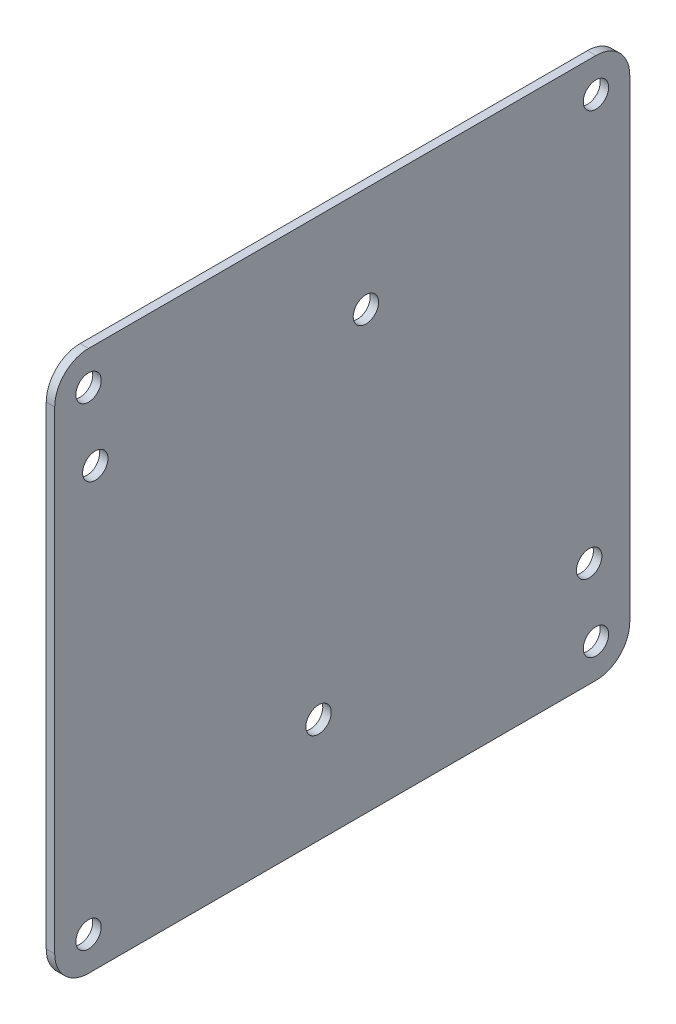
ISO-10303-21;
HEADER;
FILE_DESCRIPTION(('STEP AP214'),'2;1');
FILE_NAME('part.step','',(''),(''),'','','');
FILE_SCHEMA(('AUTOMOTIVE_DESIGN { 1 0 10303 214 1 1 1 1 }'));
ENDSEC;
DATA;
#1=APPLICATION_CONTEXT('core data for automotive mechanical design processes');
#2=APPLICATION_PROTOCOL_DEFINITION('international standard','automotive_design',2000,#1);
#3=PRODUCT_CONTEXT('',#1,'mechanical');
#4=PRODUCT('Part','Part','',(#3));
#5=PRODUCT_RELATED_PRODUCT_CATEGORY('part','',(#4));
#6=PRODUCT_DEFINITION_FORMATION('','',#4);
#7=PRODUCT_DEFINITION_CONTEXT('part definition',#1,'design');
#8=PRODUCT_DEFINITION('design','',#6,#7);
#9=PRODUCT_DEFINITION_SHAPE('','',#8);
#10=(LENGTH_UNIT() NAMED_UNIT(*) SI_UNIT(.MILLI.,.METRE.));
#11=(NAMED_UNIT(*) PLANE_ANGLE_UNIT() SI_UNIT($,.RADIAN.));
#12=(NAMED_UNIT(*) SI_UNIT($,.STERADIAN.) SOLID_ANGLE_UNIT());
#13=UNCERTAINTY_MEASURE_WITH_UNIT(LENGTH_MEASURE(1.E-05),#10,'distance_accuracy_value','');
#14=(GEOMETRIC_REPRESENTATION_CONTEXT(3) GLOBAL_UNCERTAINTY_ASSIGNED_CONTEXT((#13)) GLOBAL_UNIT_ASSIGNED_CONTEXT((#10,
#11,#12)) REPRESENTATION_CONTEXT('',''));
#15=CARTESIAN_POINT('',(0.,0.,0.));
#16=DIRECTION('',(0.,0.,1.));
#17=DIRECTION('',(1.,0.,0.));
#18=AXIS2_PLACEMENT_3D('',#15,#16,#17);
#19=CARTESIAN_POINT('',(1.5875,0.,0.));
#20=DIRECTION('',(1.,0.,0.));
#21=DIRECTION('',(0.,0.,-1.));
#22=AXIS2_PLACEMENT_3D('',#19,#20,#21);
#23=PLANE('',#22);
#24=CARTESIAN_POINT('',(1.5875,-31.115,-46.355));
#25=DIRECTION('',(1.,0.,0.));
#26=DIRECTION('',(0.,0.,-1.));
#27=AXIS2_PLACEMENT_3D('',#24,#25,#26);
#28=CIRCLE('',#27,2.38125);
#29=CARTESIAN_POINT('',(1.5875,-31.115,-48.73625));
#30=VERTEX_POINT('',#29);
#31=EDGE_CURVE('E213',#30,#30,#28,.T.);
#32=ORIENTED_EDGE('',*,*,#31,.F.);
#33=EDGE_LOOP('',(#32));
#34=FACE_BOUND('',#33,.T.);
#35=CARTESIAN_POINT('',(1.5875,31.115,-4.44500000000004));
#36=DIRECTION('',(1.,0.,0.));
#37=DIRECTION('',(0.,0.,-1.));
#38=AXIS2_PLACEMENT_3D('',#35,#36,#37);
#39=CIRCLE('',#38,2.38125);
#40=CARTESIAN_POINT('',(1.5875,31.115,-6.82625000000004));
#41=VERTEX_POINT('',#40);
#42=EDGE_CURVE('E207',#41,#41,#39,.T.);
#43=ORIENTED_EDGE('',*,*,#42,.F.);
#44=EDGE_LOOP('',(#43));
#45=FACE_BOUND('',#44,.T.);
#46=CARTESIAN_POINT('',(1.5875,-31.115,4.44499999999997));
#47=DIRECTION('',(1.,0.,0.));
#48=DIRECTION('',(0.,0.,-1.));
#49=AXIS2_PLACEMENT_3D('',#46,#47,#48);
#50=CIRCLE('',#49,2.38125);
#51=CARTESIAN_POINT('',(1.5875,-31.115,2.06374999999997));
#52=VERTEX_POINT('',#51);
#53=EDGE_CURVE('E201',#52,#52,#50,.T.);
#54=ORIENTED_EDGE('',*,*,#53,.F.);
#55=EDGE_LOOP('',(#54));
#56=FACE_BOUND('',#55,.T.);
#57=CARTESIAN_POINT('',(1.5875,31.115,46.355));
#58=DIRECTION('',(1.,0.,0.));
#59=DIRECTION('',(0.,0.,-1.));
#60=AXIS2_PLACEMENT_3D('',#57,#58,#59);
#61=CIRCLE('',#60,2.38125);
#62=CARTESIAN_POINT('',(1.5875,31.115,43.97375));
#63=VERTEX_POINT('',#62);
#64=EDGE_CURVE('E195',#63,#63,#61,.T.);
#65=ORIENTED_EDGE('',*,*,#64,.F.);
#66=EDGE_LOOP('',(#65));
#67=FACE_BOUND('',#66,.T.);
#68=CARTESIAN_POINT('',(1.5875,-44.45,-47.625));
#69=DIRECTION('',(1.,0.,0.));
#70=DIRECTION('',(0.,0.,-1.));
#71=AXIS2_PLACEMENT_3D('',#68,#69,#70);
#72=CIRCLE('',#71,2.38125);
#73=CARTESIAN_POINT('',(1.5875,-44.45,-50.00625));
#74=VERTEX_POINT('',#73);
#75=EDGE_CURVE('E180',#74,#74,#72,.T.);
#76=ORIENTED_EDGE('',*,*,#75,.F.);
#77=EDGE_LOOP('',(#76));
#78=FACE_BOUND('',#77,.T.);
#79=CARTESIAN_POINT('',(1.5875,44.45,47.625));
#80=DIRECTION('',(1.,0.,0.));
#81=DIRECTION('',(0.,0.,-1.));
#82=AXIS2_PLACEMENT_3D('',#79,#80,#81);
#83=CIRCLE('',#82,2.38125);
#84=CARTESIAN_POINT('',(1.5875,44.45,45.24375));
#85=VERTEX_POINT('',#84);
#86=EDGE_CURVE('E163',#85,#85,#83,.T.);
#87=ORIENTED_EDGE('',*,*,#86,.F.);
#88=EDGE_LOOP('',(#87));
#89=FACE_BOUND('',#88,.T.);
#90=DIRECTION('',(0.,-1.,0.));
#91=VECTOR('',#90,1.);
#92=CARTESIAN_POINT('',(1.5875,50.8,53.975));
#93=LINE('',#92,#91);
#94=CARTESIAN_POINT('',(1.5875,44.45,53.975));
#95=VERTEX_POINT('',#94);
#96=CARTESIAN_POINT('',(1.5875,-44.45,53.975));
#97=VERTEX_POINT('',#96);
#98=EDGE_CURVE('E170',#95,#97,#93,.T.);
#99=ORIENTED_EDGE('',*,*,#98,.T.);
#100=CARTESIAN_POINT('',(1.5875,-44.45,47.625));
#101=DIRECTION('',(1.,0.,0.));
#102=DIRECTION('',(0.,0.,-1.));
#103=AXIS2_PLACEMENT_3D('',#100,#101,#102);
#104=CIRCLE('',#103,6.35);
#105=CARTESIAN_POINT('',(1.5875,-50.8,47.625));
#106=VERTEX_POINT('',#105);
#107=EDGE_CURVE('E147',#97,#106,#104,.T.);
#108=ORIENTED_EDGE('',*,*,#107,.T.);
#109=DIRECTION('',(0.,0.,-1.));
#110=VECTOR('',#109,1.);
#111=CARTESIAN_POINT('',(1.5875,-50.8,53.975));
#112=LINE('',#111,#110);
#113=CARTESIAN_POINT('',(1.5875,-50.8,-47.625));
#114=VERTEX_POINT('',#113);
#115=EDGE_CURVE('E118',#106,#114,#112,.T.);
#116=ORIENTED_EDGE('',*,*,#115,.T.);
#117=CARTESIAN_POINT('',(1.5875,-44.45,-47.625));
#118=DIRECTION('',(1.,0.,0.));
#119=DIRECTION('',(0.,0.,-1.));
#120=AXIS2_PLACEMENT_3D('',#117,#118,#119);
#121=CIRCLE('',#120,6.35);
#122=CARTESIAN_POINT('',(1.5875,-44.45,-53.975));
#123=VERTEX_POINT('',#122);
#124=EDGE_CURVE('E145',#114,#123,#121,.T.);
#125=ORIENTED_EDGE('',*,*,#124,.T.);
#126=DIRECTION('',(0.,1.,0.));
#127=VECTOR('',#126,1.);
#128=CARTESIAN_POINT('',(1.5875,50.8,-53.975));
#129=LINE('',#128,#127);
#130=CARTESIAN_POINT('',(1.5875,44.45,-53.975));
#131=VERTEX_POINT('',#130);
#132=EDGE_CURVE('E125',#123,#131,#129,.T.);
#133=ORIENTED_EDGE('',*,*,#132,.T.);
#134=CARTESIAN_POINT('',(1.5875,44.45,-47.625));
#135=DIRECTION('',(1.,0.,0.));
#136=DIRECTION('',(0.,0.,-1.));
#137=AXIS2_PLACEMENT_3D('',#134,#135,#136);
#138=CIRCLE('',#137,6.35);
#139=CARTESIAN_POINT('',(1.5875,50.8,-47.625));
#140=VERTEX_POINT('',#139);
#141=EDGE_CURVE('E53',#131,#140,#138,.T.);
#142=ORIENTED_EDGE('',*,*,#141,.T.);
#143=DIRECTION('',(0.,0.,1.));
#144=VECTOR('',#143,1.);
#145=CARTESIAN_POINT('',(1.5875,50.8,53.975));
#146=LINE('',#145,#144);
#147=CARTESIAN_POINT('',(1.5875,50.8,47.625));
#148=VERTEX_POINT('',#147);
#149=EDGE_CURVE('E128',#140,#148,#146,.T.);
#150=ORIENTED_EDGE('',*,*,#149,.T.);
#151=CARTESIAN_POINT('',(1.5875,44.45,47.625));
#152=DIRECTION('',(1.,0.,0.));
#153=DIRECTION('',(0.,0.,-1.));
#154=AXIS2_PLACEMENT_3D('',#151,#152,#153);
#155=CIRCLE('',#154,6.35);
#156=EDGE_CURVE('E142',#148,#95,#155,.T.);
#157=ORIENTED_EDGE('',*,*,#156,.T.);
#158=EDGE_LOOP('',(#99,#108,#116,#125,#133,#142,#150,#157));
#159=FACE_BOUND('',#158,.T.);
#160=CARTESIAN_POINT('',(1.5875,44.45,-47.625));
#161=DIRECTION('',(1.,0.,0.));
#162=DIRECTION('',(0.,0.,-1.));
#163=AXIS2_PLACEMENT_3D('',#160,#161,#162);
#164=CIRCLE('',#163,2.38125);
#165=CARTESIAN_POINT('',(1.5875,44.45,-50.00625));
#166=VERTEX_POINT('',#165);
#167=EDGE_CURVE('E175',#166,#166,#164,.T.);
#168=ORIENTED_EDGE('',*,*,#167,.F.);
#169=EDGE_LOOP('',(#168));
#170=FACE_BOUND('',#169,.T.);
#171=CARTESIAN_POINT('',(1.5875,-44.45,47.625));
#172=DIRECTION('',(1.,0.,0.));
#173=DIRECTION('',(0.,0.,-1.));
#174=AXIS2_PLACEMENT_3D('',#171,#172,#173);
#175=CIRCLE('',#174,2.38125);
#176=CARTESIAN_POINT('',(1.5875,-44.45,45.24375));
#177=VERTEX_POINT('',#176);
#178=EDGE_CURVE('E186',#177,#177,#175,.T.);
#179=ORIENTED_EDGE('',*,*,#178,.F.);
#180=EDGE_LOOP('',(#179));
#181=FACE_BOUND('',#180,.T.);
#182=ADVANCED_FACE('F32',(#34,#45,#56,#67,#78,#89,#159,#170,#181),#23,.T.);
#183=CARTESIAN_POINT('',(0.,0.,0.));
#184=DIRECTION('',(1.,0.,0.));
#185=DIRECTION('',(0.,0.,-1.));
#186=AXIS2_PLACEMENT_3D('',#183,#184,#185);
#187=PLANE('',#186);
#188=CARTESIAN_POINT('',(0.,-31.115,-46.355));
#189=DIRECTION('',(1.,0.,0.));
#190=DIRECTION('',(0.,0.,-1.));
#191=AXIS2_PLACEMENT_3D('',#188,#189,#190);
#192=CIRCLE('',#191,2.38125);
#193=CARTESIAN_POINT('',(0.,-31.115,-48.73625));
#194=VERTEX_POINT('',#193);
#195=EDGE_CURVE('E210',#194,#194,#192,.T.);
#196=ORIENTED_EDGE('',*,*,#195,.T.);
#197=EDGE_LOOP('',(#196));
#198=FACE_BOUND('',#197,.T.);
#199=CARTESIAN_POINT('',(0.,31.115,-4.44500000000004));
#200=DIRECTION('',(1.,0.,0.));
#201=DIRECTION('',(0.,0.,-1.));
#202=AXIS2_PLACEMENT_3D('',#199,#200,#201);
#203=CIRCLE('',#202,2.38125);
#204=CARTESIAN_POINT('',(0.,31.115,-6.82625000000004));
#205=VERTEX_POINT('',#204);
#206=EDGE_CURVE('E204',#205,#205,#203,.T.);
#207=ORIENTED_EDGE('',*,*,#206,.T.);
#208=EDGE_LOOP('',(#207));
#209=FACE_BOUND('',#208,.T.);
#210=CARTESIAN_POINT('',(0.,-31.115,4.44499999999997));
#211=DIRECTION('',(1.,0.,0.));
#212=DIRECTION('',(0.,0.,-1.));
#213=AXIS2_PLACEMENT_3D('',#210,#211,#212);
#214=CIRCLE('',#213,2.38125);
#215=CARTESIAN_POINT('',(0.,-31.115,2.06374999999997));
#216=VERTEX_POINT('',#215);
#217=EDGE_CURVE('E198',#216,#216,#214,.T.);
#218=ORIENTED_EDGE('',*,*,#217,.T.);
#219=EDGE_LOOP('',(#218));
#220=FACE_BOUND('',#219,.T.);
#221=CARTESIAN_POINT('',(0.,31.115,46.355));
#222=DIRECTION('',(1.,0.,0.));
#223=DIRECTION('',(0.,0.,-1.));
#224=AXIS2_PLACEMENT_3D('',#221,#222,#223);
#225=CIRCLE('',#224,2.38125);
#226=CARTESIAN_POINT('',(0.,31.115,43.97375));
#227=VERTEX_POINT('',#226);
#228=EDGE_CURVE('E192',#227,#227,#225,.T.);
#229=ORIENTED_EDGE('',*,*,#228,.T.);
#230=EDGE_LOOP('',(#229));
#231=FACE_BOUND('',#230,.T.);
#232=DIRECTION('',(0.,0.,-1.));
#233=VECTOR('',#232,1.);
#234=CARTESIAN_POINT('',(0.,-50.8,53.975));
#235=LINE('',#234,#233);
#236=CARTESIAN_POINT('',(0.,-50.8,47.625));
#237=VERTEX_POINT('',#236);
#238=CARTESIAN_POINT('',(0.,-50.8,-47.625));
#239=VERTEX_POINT('',#238);
#240=EDGE_CURVE('E115',#237,#239,#235,.T.);
#241=ORIENTED_EDGE('',*,*,#240,.F.);
#242=CARTESIAN_POINT('',(0.,-44.45,47.625));
#243=DIRECTION('',(1.,0.,0.));
#244=DIRECTION('',(0.,0.,-1.));
#245=AXIS2_PLACEMENT_3D('',#242,#243,#244);
#246=CIRCLE('',#245,6.35);
#247=CARTESIAN_POINT('',(0.,-44.45,53.975));
#248=VERTEX_POINT('',#247);
#249=EDGE_CURVE('E98',#237,#248,#246,.F.);
#250=ORIENTED_EDGE('',*,*,#249,.T.);
#251=DIRECTION('',(0.,-1.,0.));
#252=VECTOR('',#251,1.);
#253=CARTESIAN_POINT('',(0.,50.8,53.975));
#254=LINE('',#253,#252);
#255=CARTESIAN_POINT('',(0.,44.45,53.975));
#256=VERTEX_POINT('',#255);
#257=EDGE_CURVE('E126',#256,#248,#254,.T.);
#258=ORIENTED_EDGE('',*,*,#257,.F.);
#259=CARTESIAN_POINT('',(0.,44.45,47.625));
#260=DIRECTION('',(1.,0.,0.));
#261=DIRECTION('',(0.,0.,-1.));
#262=AXIS2_PLACEMENT_3D('',#259,#260,#261);
#263=CIRCLE('',#262,6.35);
#264=CARTESIAN_POINT('',(0.,50.8,47.625));
#265=VERTEX_POINT('',#264);
#266=EDGE_CURVE('E119',#256,#265,#263,.F.);
#267=ORIENTED_EDGE('',*,*,#266,.T.);
#268=DIRECTION('',(0.,0.,1.));
#269=VECTOR('',#268,1.);
#270=CARTESIAN_POINT('',(0.,50.8,53.975));
#271=LINE('',#270,#269);
#272=CARTESIAN_POINT('',(0.,50.8,-47.625));
#273=VERTEX_POINT('',#272);
#274=EDGE_CURVE('E130',#273,#265,#271,.T.);
#275=ORIENTED_EDGE('',*,*,#274,.F.);
#276=CARTESIAN_POINT('',(0.,44.45,-47.625));
#277=DIRECTION('',(1.,0.,0.));
#278=DIRECTION('',(0.,0.,-1.));
#279=AXIS2_PLACEMENT_3D('',#276,#277,#278);
#280=CIRCLE('',#279,6.35);
#281=CARTESIAN_POINT('',(0.,44.45,-53.975));
#282=VERTEX_POINT('',#281);
#283=EDGE_CURVE('E136',#273,#282,#280,.F.);
#284=ORIENTED_EDGE('',*,*,#283,.T.);
#285=DIRECTION('',(0.,1.,0.));
#286=VECTOR('',#285,1.);
#287=CARTESIAN_POINT('',(0.,50.8,-53.975));
#288=LINE('',#287,#286);
#289=CARTESIAN_POINT('',(0.,-44.45,-53.975));
#290=VERTEX_POINT('',#289);
#291=EDGE_CURVE('E158',#290,#282,#288,.T.);
#292=ORIENTED_EDGE('',*,*,#291,.F.);
#293=CARTESIAN_POINT('',(0.,-44.45,-47.625));
#294=DIRECTION('',(1.,0.,0.));
#295=DIRECTION('',(0.,0.,-1.));
#296=AXIS2_PLACEMENT_3D('',#293,#294,#295);
#297=CIRCLE('',#296,6.35);
#298=EDGE_CURVE('E109',#290,#239,#297,.F.);
#299=ORIENTED_EDGE('',*,*,#298,.T.);
#300=EDGE_LOOP('',(#241,#250,#258,#267,#275,#284,#292,#299));
#301=FACE_BOUND('',#300,.T.);
#302=CARTESIAN_POINT('',(0.,44.45,47.625));
#303=DIRECTION('',(1.,0.,0.));
#304=DIRECTION('',(0.,0.,-1.));
#305=AXIS2_PLACEMENT_3D('',#302,#303,#304);
#306=CIRCLE('',#305,2.38125);
#307=CARTESIAN_POINT('',(0.,44.45,45.24375));
#308=VERTEX_POINT('',#307);
#309=EDGE_CURVE('E166',#308,#308,#306,.T.);
#310=ORIENTED_EDGE('',*,*,#309,.T.);
#311=EDGE_LOOP('',(#310));
#312=FACE_BOUND('',#311,.T.);
#313=CARTESIAN_POINT('',(0.,44.45,-47.625));
#314=DIRECTION('',(1.,0.,0.));
#315=DIRECTION('',(0.,0.,-1.));
#316=AXIS2_PLACEMENT_3D('',#313,#314,#315);
#317=CIRCLE('',#316,2.38125);
#318=CARTESIAN_POINT('',(0.,44.45,-50.00625));
#319=VERTEX_POINT('',#318);
#320=EDGE_CURVE('E177',#319,#319,#317,.T.);
#321=ORIENTED_EDGE('',*,*,#320,.T.);
#322=EDGE_LOOP('',(#321));
#323=FACE_BOUND('',#322,.T.);
#324=CARTESIAN_POINT('',(0.,-44.45,-47.625));
#325=DIRECTION('',(1.,0.,0.));
#326=DIRECTION('',(0.,0.,-1.));
#327=AXIS2_PLACEMENT_3D('',#324,#325,#326);
#328=CIRCLE('',#327,2.38125);
#329=CARTESIAN_POINT('',(0.,-44.45,-50.00625));
#330=VERTEX_POINT('',#329);
#331=EDGE_CURVE('E183',#330,#330,#328,.T.);
#332=ORIENTED_EDGE('',*,*,#331,.T.);
#333=EDGE_LOOP('',(#332));
#334=FACE_BOUND('',#333,.T.);
#335=CARTESIAN_POINT('',(0.,-44.45,47.625));
#336=DIRECTION('',(1.,0.,0.));
#337=DIRECTION('',(0.,0.,-1.));
#338=AXIS2_PLACEMENT_3D('',#335,#336,#337);
#339=CIRCLE('',#338,2.38125);
#340=CARTESIAN_POINT('',(0.,-44.45,45.24375));
#341=VERTEX_POINT('',#340);
#342=EDGE_CURVE('E189',#341,#341,#339,.T.);
#343=ORIENTED_EDGE('',*,*,#342,.T.);
#344=EDGE_LOOP('',(#343));
#345=FACE_BOUND('',#344,.T.);
#346=ADVANCED_FACE('F122',(#198,#209,#220,#231,#301,#312,#323,#334,#345),#187,.F.);
#347=CARTESIAN_POINT('',(1.5875,50.8,-53.975));
#348=DIRECTION('',(0.,0.,1.));
#349=DIRECTION('',(0.,-1.,0.));
#350=AXIS2_PLACEMENT_3D('',#347,#348,#349);
#351=PLANE('',#350);
#352=ORIENTED_EDGE('',*,*,#132,.F.);
#353=DIRECTION('',(-1.,0.,0.));
#354=VECTOR('',#353,1.);
#355=CARTESIAN_POINT('',(1.5875,-44.45,-53.975));
#356=LINE('',#355,#354);
#357=EDGE_CURVE('E151',#123,#290,#356,.T.);
#358=ORIENTED_EDGE('',*,*,#357,.T.);
#359=ORIENTED_EDGE('',*,*,#291,.T.);
#360=DIRECTION('',(-1.,0.,0.));
#361=VECTOR('',#360,1.);
#362=CARTESIAN_POINT('',(1.5875,44.45,-53.975));
#363=LINE('',#362,#361);
#364=EDGE_CURVE('E149',#282,#131,#363,.F.);
#365=ORIENTED_EDGE('',*,*,#364,.T.);
#366=EDGE_LOOP('',(#352,#358,#359,#365));
#367=FACE_BOUND('',#366,.T.);
#368=ADVANCED_FACE('F157',(#367),#351,.F.);
#369=CARTESIAN_POINT('',(1.5875,50.8,53.975));
#370=DIRECTION('',(0.,-1.,0.));
#371=DIRECTION('',(0.,0.,-1.));
#372=AXIS2_PLACEMENT_3D('',#369,#370,#371);
#373=PLANE('',#372);
#374=ORIENTED_EDGE('',*,*,#149,.F.);
#375=DIRECTION('',(-1.,0.,0.));
#376=VECTOR('',#375,1.);
#377=CARTESIAN_POINT('',(1.5875,50.8,-47.625));
#378=LINE('',#377,#376);
#379=EDGE_CURVE('E11',#140,#273,#378,.T.);
#380=ORIENTED_EDGE('',*,*,#379,.T.);
#381=ORIENTED_EDGE('',*,*,#274,.T.);
#382=DIRECTION('',(-1.,0.,0.));
#383=VECTOR('',#382,1.);
#384=CARTESIAN_POINT('',(1.5875,50.8,47.625));
#385=LINE('',#384,#383);
#386=EDGE_CURVE('E40',#265,#148,#385,.F.);
#387=ORIENTED_EDGE('',*,*,#386,.T.);
#388=EDGE_LOOP('',(#374,#380,#381,#387));
#389=FACE_BOUND('',#388,.T.);
#390=ADVANCED_FACE('F258',(#389),#373,.F.);
#391=CARTESIAN_POINT('',(1.5875,50.8,53.975));
#392=DIRECTION('',(0.,0.,-1.));
#393=DIRECTION('',(-1.,0.,0.));
#394=AXIS2_PLACEMENT_3D('',#391,#392,#393);
#395=PLANE('',#394);
#396=ORIENTED_EDGE('',*,*,#257,.T.);
#397=DIRECTION('',(-1.,0.,0.));
#398=VECTOR('',#397,1.);
#399=CARTESIAN_POINT('',(1.5875,-44.45,53.975));
#400=LINE('',#399,#398);
#401=EDGE_CURVE('E103',#248,#97,#400,.F.);
#402=ORIENTED_EDGE('',*,*,#401,.T.);
#403=ORIENTED_EDGE('',*,*,#98,.F.);
#404=DIRECTION('',(-1.,0.,0.));
#405=VECTOR('',#404,1.);
#406=CARTESIAN_POINT('',(1.5875,44.45,53.975));
#407=LINE('',#406,#405);
#408=EDGE_CURVE('E108',#95,#256,#407,.T.);
#409=ORIENTED_EDGE('',*,*,#408,.T.);
#410=EDGE_LOOP('',(#396,#402,#403,#409));
#411=FACE_BOUND('',#410,.T.);
#412=ADVANCED_FACE('F265',(#411),#395,.F.);
#413=CARTESIAN_POINT('',(1.5875,-50.8,53.975));
#414=DIRECTION('',(0.,1.,0.));
#415=DIRECTION('',(0.,0.,1.));
#416=AXIS2_PLACEMENT_3D('',#413,#414,#415);
#417=PLANE('',#416);
#418=ORIENTED_EDGE('',*,*,#115,.F.);
#419=DIRECTION('',(-1.,0.,0.));
#420=VECTOR('',#419,1.);
#421=CARTESIAN_POINT('',(1.5875,-50.8,47.625));
#422=LINE('',#421,#420);
#423=EDGE_CURVE('E102',#106,#237,#422,.T.);
#424=ORIENTED_EDGE('',*,*,#423,.T.);
#425=ORIENTED_EDGE('',*,*,#240,.T.);
#426=DIRECTION('',(-1.,0.,0.));
#427=VECTOR('',#426,1.);
#428=CARTESIAN_POINT('',(1.5875,-50.8,-47.625));
#429=LINE('',#428,#427);
#430=EDGE_CURVE('E120',#239,#114,#429,.F.);
#431=ORIENTED_EDGE('',*,*,#430,.T.);
#432=EDGE_LOOP('',(#418,#424,#425,#431));
#433=FACE_BOUND('',#432,.T.);
#434=ADVANCED_FACE('F114',(#433),#417,.F.);
#435=CARTESIAN_POINT('',(1.5875,44.45,47.625));
#436=DIRECTION('',(-1.,0.,0.));
#437=DIRECTION('',(0.,0.,1.));
#438=AXIS2_PLACEMENT_3D('',#435,#436,#437);
#439=CYLINDRICAL_SURFACE('',#438,2.38125);
#440=ORIENTED_EDGE('',*,*,#86,.T.);
#441=EDGE_LOOP('',(#440));
#442=FACE_BOUND('',#441,.T.);
#443=ORIENTED_EDGE('',*,*,#309,.F.);
#444=EDGE_LOOP('',(#443));
#445=FACE_BOUND('',#444,.T.);
#446=ADVANCED_FACE('F264',(#442,#445),#439,.F.);
#447=CARTESIAN_POINT('',(1.5875,44.45,-47.625));
#448=DIRECTION('',(-1.,0.,0.));
#449=DIRECTION('',(0.,0.,1.));
#450=AXIS2_PLACEMENT_3D('',#447,#448,#449);
#451=CYLINDRICAL_SURFACE('',#450,2.38125);
#452=ORIENTED_EDGE('',*,*,#167,.T.);
#453=EDGE_LOOP('',(#452));
#454=FACE_BOUND('',#453,.T.);
#455=ORIENTED_EDGE('',*,*,#320,.F.);
#456=EDGE_LOOP('',(#455));
#457=FACE_BOUND('',#456,.T.);
#458=ADVANCED_FACE('F303',(#454,#457),#451,.F.);
#459=CARTESIAN_POINT('',(1.5875,-44.45,-47.625));
#460=DIRECTION('',(-1.,0.,0.));
#461=DIRECTION('',(0.,0.,1.));
#462=AXIS2_PLACEMENT_3D('',#459,#460,#461);
#463=CYLINDRICAL_SURFACE('',#462,2.38125);
#464=ORIENTED_EDGE('',*,*,#75,.T.);
#465=EDGE_LOOP('',(#464));
#466=FACE_BOUND('',#465,.T.);
#467=ORIENTED_EDGE('',*,*,#331,.F.);
#468=EDGE_LOOP('',(#467));
#469=FACE_BOUND('',#468,.T.);
#470=ADVANCED_FACE('F249',(#466,#469),#463,.F.);
#471=CARTESIAN_POINT('',(1.5875,-44.45,47.625));
#472=DIRECTION('',(-1.,0.,0.));
#473=DIRECTION('',(0.,0.,1.));
#474=AXIS2_PLACEMENT_3D('',#471,#472,#473);
#475=CYLINDRICAL_SURFACE('',#474,2.38125);
#476=ORIENTED_EDGE('',*,*,#178,.T.);
#477=EDGE_LOOP('',(#476));
#478=FACE_BOUND('',#477,.T.);
#479=ORIENTED_EDGE('',*,*,#342,.F.);
#480=EDGE_LOOP('',(#479));
#481=FACE_BOUND('',#480,.T.);
#482=ADVANCED_FACE('F246',(#478,#481),#475,.F.);
#483=CARTESIAN_POINT('',(1.5875,-44.45,47.625));
#484=DIRECTION('',(-1.,0.,0.));
#485=DIRECTION('',(0.,0.,1.));
#486=AXIS2_PLACEMENT_3D('',#483,#484,#485);
#487=CYLINDRICAL_SURFACE('',#486,6.35);
#488=ORIENTED_EDGE('',*,*,#107,.F.);
#489=ORIENTED_EDGE('',*,*,#401,.F.);
#490=ORIENTED_EDGE('',*,*,#249,.F.);
#491=ORIENTED_EDGE('',*,*,#423,.F.);
#492=EDGE_LOOP('',(#488,#489,#490,#491));
#493=FACE_BOUND('',#492,.T.);
#494=ADVANCED_FACE('F101',(#493),#487,.T.);
#495=CARTESIAN_POINT('',(1.5875,-44.45,-47.625));
#496=DIRECTION('',(-1.,0.,0.));
#497=DIRECTION('',(0.,0.,1.));
#498=AXIS2_PLACEMENT_3D('',#495,#496,#497);
#499=CYLINDRICAL_SURFACE('',#498,6.35);
#500=ORIENTED_EDGE('',*,*,#124,.F.);
#501=ORIENTED_EDGE('',*,*,#430,.F.);
#502=ORIENTED_EDGE('',*,*,#298,.F.);
#503=ORIENTED_EDGE('',*,*,#357,.F.);
#504=EDGE_LOOP('',(#500,#501,#502,#503));
#505=FACE_BOUND('',#504,.T.);
#506=ADVANCED_FACE('F273',(#505),#499,.T.);
#507=CARTESIAN_POINT('',(1.5875,44.45,-47.625));
#508=DIRECTION('',(-1.,0.,0.));
#509=DIRECTION('',(0.,0.,1.));
#510=AXIS2_PLACEMENT_3D('',#507,#508,#509);
#511=CYLINDRICAL_SURFACE('',#510,6.35);
#512=ORIENTED_EDGE('',*,*,#141,.F.);
#513=ORIENTED_EDGE('',*,*,#364,.F.);
#514=ORIENTED_EDGE('',*,*,#283,.F.);
#515=ORIENTED_EDGE('',*,*,#379,.F.);
#516=EDGE_LOOP('',(#512,#513,#514,#515));
#517=FACE_BOUND('',#516,.T.);
#518=ADVANCED_FACE('F275',(#517),#511,.T.);
#519=CARTESIAN_POINT('',(1.5875,44.45,47.625));
#520=DIRECTION('',(-1.,0.,0.));
#521=DIRECTION('',(0.,0.,1.));
#522=AXIS2_PLACEMENT_3D('',#519,#520,#521);
#523=CYLINDRICAL_SURFACE('',#522,6.35);
#524=ORIENTED_EDGE('',*,*,#156,.F.);
#525=ORIENTED_EDGE('',*,*,#386,.F.);
#526=ORIENTED_EDGE('',*,*,#266,.F.);
#527=ORIENTED_EDGE('',*,*,#408,.F.);
#528=EDGE_LOOP('',(#524,#525,#526,#527));
#529=FACE_BOUND('',#528,.T.);
#530=ADVANCED_FACE('F34',(#529),#523,.T.);
#531=CARTESIAN_POINT('',(0.,31.115,46.355));
#532=DIRECTION('',(1.,0.,0.));
#533=DIRECTION('',(0.,0.,-1.));
#534=AXIS2_PLACEMENT_3D('',#531,#532,#533);
#535=CYLINDRICAL_SURFACE('',#534,2.38125);
#536=ORIENTED_EDGE('',*,*,#228,.F.);
#537=EDGE_LOOP('',(#536));
#538=FACE_BOUND('',#537,.T.);
#539=ORIENTED_EDGE('',*,*,#64,.T.);
#540=EDGE_LOOP('',(#539));
#541=FACE_BOUND('',#540,.T.);
#542=ADVANCED_FACE('F281',(#538,#541),#535,.F.);
#543=CARTESIAN_POINT('',(0.,-31.115,4.44499999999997));
#544=DIRECTION('',(1.,0.,0.));
#545=DIRECTION('',(0.,0.,-1.));
#546=AXIS2_PLACEMENT_3D('',#543,#544,#545);
#547=CYLINDRICAL_SURFACE('',#546,2.38125);
#548=ORIENTED_EDGE('',*,*,#217,.F.);
#549=EDGE_LOOP('',(#548));
#550=FACE_BOUND('',#549,.T.);
#551=ORIENTED_EDGE('',*,*,#53,.T.);
#552=EDGE_LOOP('',(#551));
#553=FACE_BOUND('',#552,.T.);
#554=ADVANCED_FACE('F289',(#550,#553),#547,.F.);
#555=CARTESIAN_POINT('',(0.,31.115,-4.44500000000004));
#556=DIRECTION('',(1.,0.,0.));
#557=DIRECTION('',(0.,0.,-1.));
#558=AXIS2_PLACEMENT_3D('',#555,#556,#557);
#559=CYLINDRICAL_SURFACE('',#558,2.38125);
#560=ORIENTED_EDGE('',*,*,#206,.F.);
#561=EDGE_LOOP('',(#560));
#562=FACE_BOUND('',#561,.T.);
#563=ORIENTED_EDGE('',*,*,#42,.T.);
#564=EDGE_LOOP('',(#563));
#565=FACE_BOUND('',#564,.T.);
#566=ADVANCED_FACE('F224',(#562,#565),#559,.F.);
#567=CARTESIAN_POINT('',(0.,-31.115,-46.355));
#568=DIRECTION('',(1.,0.,0.));
#569=DIRECTION('',(0.,0.,-1.));
#570=AXIS2_PLACEMENT_3D('',#567,#568,#569);
#571=CYLINDRICAL_SURFACE('',#570,2.38125);
#572=ORIENTED_EDGE('',*,*,#195,.F.);
#573=EDGE_LOOP('',(#572));
#574=FACE_BOUND('',#573,.T.);
#575=ORIENTED_EDGE('',*,*,#31,.T.);
#576=EDGE_LOOP('',(#575));
#577=FACE_BOUND('',#576,.T.);
#578=ADVANCED_FACE('F221',(#574,#577),#571,.F.);
#579=CLOSED_SHELL('',(#182,#346,#368,#390,#412,#434,#446,#458,#470,#482,#494,#506,#518,#530,
#542,#554,#566,#578));
#580=MANIFOLD_SOLID_BREP('B2',#579);
#581=ADVANCED_BREP_SHAPE_REPRESENTATION('',(#18,#580),#14);
#582=SHAPE_DEFINITION_REPRESENTATION(#9,#581);
ENDSEC;
END-ISO-10303-21;
